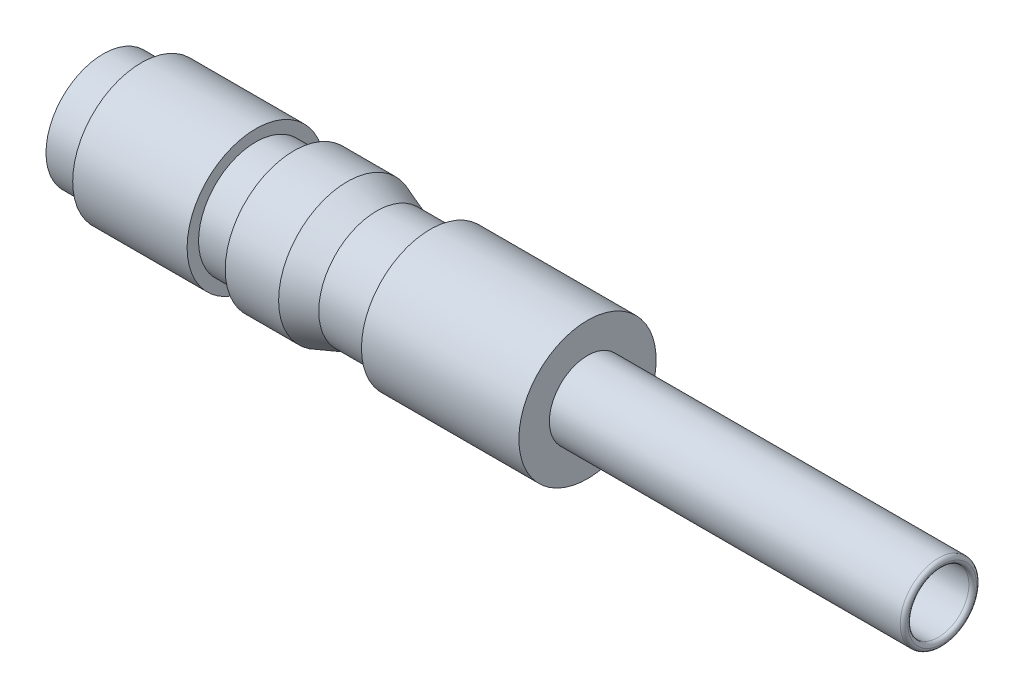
ISO-10303-21;
HEADER;
FILE_DESCRIPTION(('STEP AP214'),'2;1');
FILE_NAME('part.step','',(''),(''),'','','');
FILE_SCHEMA(('AUTOMOTIVE_DESIGN { 1 0 10303 214 1 1 1 1 }'));
ENDSEC;
DATA;
#1=APPLICATION_CONTEXT('core data for automotive mechanical design processes');
#2=APPLICATION_PROTOCOL_DEFINITION('international standard','automotive_design',2000,#1);
#3=PRODUCT_CONTEXT('',#1,'mechanical');
#4=PRODUCT('Part','Part','',(#3));
#5=PRODUCT_RELATED_PRODUCT_CATEGORY('part','',(#4));
#6=PRODUCT_DEFINITION_FORMATION('','',#4);
#7=PRODUCT_DEFINITION_CONTEXT('part definition',#1,'design');
#8=PRODUCT_DEFINITION('design','',#6,#7);
#9=PRODUCT_DEFINITION_SHAPE('','',#8);
#10=(LENGTH_UNIT() NAMED_UNIT(*) SI_UNIT(.MILLI.,.METRE.));
#11=(NAMED_UNIT(*) PLANE_ANGLE_UNIT() SI_UNIT($,.RADIAN.));
#12=(NAMED_UNIT(*) SI_UNIT($,.STERADIAN.) SOLID_ANGLE_UNIT());
#13=UNCERTAINTY_MEASURE_WITH_UNIT(LENGTH_MEASURE(1.E-05),#10,'distance_accuracy_value','');
#14=(GEOMETRIC_REPRESENTATION_CONTEXT(3) GLOBAL_UNCERTAINTY_ASSIGNED_CONTEXT((#13)) GLOBAL_UNIT_ASSIGNED_CONTEXT((#10,
#11,#12)) REPRESENTATION_CONTEXT('',''));
#15=CARTESIAN_POINT('',(0.,0.,0.));
#16=DIRECTION('',(0.,0.,1.));
#17=DIRECTION('',(1.,0.,0.));
#18=AXIS2_PLACEMENT_3D('',#15,#16,#17);
#19=CARTESIAN_POINT('',(5.,0.,0.));
#20=DIRECTION('',(1.,0.,0.));
#21=DIRECTION('',(0.,0.,-1.));
#22=AXIS2_PLACEMENT_3D('',#19,#20,#21);
#23=CYLINDRICAL_SURFACE('',#22,0.4);
#24=CARTESIAN_POINT('',(10.95,0.,0.));
#25=DIRECTION('',(-1.,0.,0.));
#26=DIRECTION('',(0.,0.,1.));
#27=AXIS2_PLACEMENT_3D('',#24,#25,#26);
#28=CIRCLE('',#27,0.4);
#29=CARTESIAN_POINT('',(10.95,0.,0.4));
#30=VERTEX_POINT('',#29);
#31=EDGE_CURVE('E41',#30,#30,#28,.F.);
#32=ORIENTED_EDGE('',*,*,#31,.T.);
#33=EDGE_LOOP('',(#32));
#34=FACE_BOUND('',#33,.T.);
#35=CARTESIAN_POINT('',(6.,0.,0.));
#36=DIRECTION('',(-1.,0.,0.));
#37=DIRECTION('',(0.,0.,1.));
#38=AXIS2_PLACEMENT_3D('',#35,#36,#37);
#39=CIRCLE('',#38,0.4);
#40=CARTESIAN_POINT('',(6.,0.,0.4));
#41=VERTEX_POINT('',#40);
#42=EDGE_CURVE('E48',#41,#41,#39,.F.);
#43=ORIENTED_EDGE('',*,*,#42,.F.);
#44=EDGE_LOOP('',(#43));
#45=FACE_BOUND('',#44,.T.);
#46=ADVANCED_FACE('F33',(#34,#45),#23,.F.);
#47=CARTESIAN_POINT('',(0.,0.,0.));
#48=DIRECTION('',(1.,0.,0.));
#49=DIRECTION('',(0.,0.,-1.));
#50=AXIS2_PLACEMENT_3D('',#47,#48,#49);
#51=PLANE('',#50);
#52=CARTESIAN_POINT('',(0.,0.,0.));
#53=DIRECTION('',(-1.,0.,0.));
#54=DIRECTION('',(0.,0.,1.));
#55=AXIS2_PLACEMENT_3D('',#52,#53,#54);
#56=CIRCLE('',#55,0.6);
#57=CARTESIAN_POINT('',(0.,0.,0.6));
#58=VERTEX_POINT('',#57);
#59=EDGE_CURVE('E90',#58,#58,#56,.T.);
#60=ORIENTED_EDGE('',*,*,#59,.F.);
#61=EDGE_LOOP('',(#60));
#62=FACE_BOUND('',#61,.T.);
#63=CARTESIAN_POINT('',(0.,0.,0.));
#64=DIRECTION('',(-1.,0.,0.));
#65=DIRECTION('',(0.,0.,1.));
#66=AXIS2_PLACEMENT_3D('',#63,#64,#65);
#67=CIRCLE('',#66,0.75);
#68=CARTESIAN_POINT('',(0.,0.,0.75));
#69=VERTEX_POINT('',#68);
#70=EDGE_CURVE('E45',#69,#69,#67,.T.);
#71=ORIENTED_EDGE('',*,*,#70,.T.);
#72=EDGE_LOOP('',(#71));
#73=FACE_BOUND('',#72,.T.);
#74=ADVANCED_FACE('F105',(#62,#73),#51,.F.);
#75=CARTESIAN_POINT('',(-4.99745454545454,0.,0.));
#76=DIRECTION('',(-1.,0.,0.));
#77=DIRECTION('',(0.,0.,1.));
#78=AXIS2_PLACEMENT_3D('',#75,#76,#77);
#79=CYLINDRICAL_SURFACE('',#78,0.749999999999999);
#80=ORIENTED_EDGE('',*,*,#70,.F.);
#81=EDGE_LOOP('',(#80));
#82=FACE_BOUND('',#81,.T.);
#83=CARTESIAN_POINT('',(0.5,0.,0.));
#84=DIRECTION('',(-1.,0.,0.));
#85=DIRECTION('',(0.,0.,1.));
#86=AXIS2_PLACEMENT_3D('',#83,#84,#85);
#87=CIRCLE('',#86,0.749999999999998);
#88=CARTESIAN_POINT('',(0.5,0.,0.749999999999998));
#89=VERTEX_POINT('',#88);
#90=EDGE_CURVE('E55',#89,#89,#87,.T.);
#91=ORIENTED_EDGE('',*,*,#90,.T.);
#92=EDGE_LOOP('',(#91));
#93=FACE_BOUND('',#92,.T.);
#94=ADVANCED_FACE('F108',(#82,#93),#79,.T.);
#95=CARTESIAN_POINT('',(0.5,0.749999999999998,0.));
#96=DIRECTION('',(1.,0.,0.));
#97=DIRECTION('',(0.,0.,-1.));
#98=AXIS2_PLACEMENT_3D('',#95,#96,#97);
#99=PLANE('',#98);
#100=ORIENTED_EDGE('',*,*,#90,.F.);
#101=EDGE_LOOP('',(#100));
#102=FACE_BOUND('',#101,.T.);
#103=CARTESIAN_POINT('',(0.5,0.,0.));
#104=DIRECTION('',(-1.,0.,0.));
#105=DIRECTION('',(0.,0.,1.));
#106=AXIS2_PLACEMENT_3D('',#103,#104,#105);
#107=CIRCLE('',#106,0.899999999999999);
#108=CARTESIAN_POINT('',(0.5,0.,0.899999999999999));
#109=VERTEX_POINT('',#108);
#110=EDGE_CURVE('E58',#109,#109,#107,.T.);
#111=ORIENTED_EDGE('',*,*,#110,.T.);
#112=EDGE_LOOP('',(#111));
#113=FACE_BOUND('',#112,.T.);
#114=ADVANCED_FACE('F114',(#102,#113),#99,.F.);
#115=CARTESIAN_POINT('',(-4.99745454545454,0.,0.));
#116=DIRECTION('',(-1.,0.,0.));
#117=DIRECTION('',(0.,0.,1.));
#118=AXIS2_PLACEMENT_3D('',#115,#116,#117);
#119=CYLINDRICAL_SURFACE('',#118,0.899999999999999);
#120=ORIENTED_EDGE('',*,*,#110,.F.);
#121=EDGE_LOOP('',(#120));
#122=FACE_BOUND('',#121,.T.);
#123=CARTESIAN_POINT('',(2.,0.,0.));
#124=DIRECTION('',(-1.,0.,0.));
#125=DIRECTION('',(0.,0.,1.));
#126=AXIS2_PLACEMENT_3D('',#123,#124,#125);
#127=CIRCLE('',#126,0.899999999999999);
#128=CARTESIAN_POINT('',(2.,0.,0.899999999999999));
#129=VERTEX_POINT('',#128);
#130=EDGE_CURVE('E61',#129,#129,#127,.T.);
#131=ORIENTED_EDGE('',*,*,#130,.T.);
#132=EDGE_LOOP('',(#131));
#133=FACE_BOUND('',#132,.T.);
#134=ADVANCED_FACE('F120',(#122,#133),#119,.T.);
#135=CARTESIAN_POINT('',(2.,0.899999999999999,0.));
#136=DIRECTION('',(-1.,0.,0.));
#137=DIRECTION('',(0.,0.,1.));
#138=AXIS2_PLACEMENT_3D('',#135,#136,#137);
#139=PLANE('',#138);
#140=ORIENTED_EDGE('',*,*,#130,.F.);
#141=EDGE_LOOP('',(#140));
#142=FACE_BOUND('',#141,.T.);
#143=CARTESIAN_POINT('',(2.,0.,0.));
#144=DIRECTION('',(-1.,0.,0.));
#145=DIRECTION('',(0.,0.,1.));
#146=AXIS2_PLACEMENT_3D('',#143,#144,#145);
#147=CIRCLE('',#146,0.749999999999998);
#148=CARTESIAN_POINT('',(2.,0.,0.749999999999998));
#149=VERTEX_POINT('',#148);
#150=EDGE_CURVE('E64',#149,#149,#147,.T.);
#151=ORIENTED_EDGE('',*,*,#150,.T.);
#152=EDGE_LOOP('',(#151));
#153=FACE_BOUND('',#152,.T.);
#154=ADVANCED_FACE('F126',(#142,#153),#139,.F.);
#155=CARTESIAN_POINT('',(-4.99745454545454,0.,0.));
#156=DIRECTION('',(-1.,0.,0.));
#157=DIRECTION('',(0.,0.,1.));
#158=AXIS2_PLACEMENT_3D('',#155,#156,#157);
#159=CYLINDRICAL_SURFACE('',#158,0.749999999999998);
#160=ORIENTED_EDGE('',*,*,#150,.F.);
#161=EDGE_LOOP('',(#160));
#162=FACE_BOUND('',#161,.T.);
#163=CARTESIAN_POINT('',(2.5,0.,0.));
#164=DIRECTION('',(-1.,0.,0.));
#165=DIRECTION('',(0.,0.,1.));
#166=AXIS2_PLACEMENT_3D('',#163,#164,#165);
#167=CIRCLE('',#166,0.749999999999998);
#168=CARTESIAN_POINT('',(2.5,0.,0.749999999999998));
#169=VERTEX_POINT('',#168);
#170=EDGE_CURVE('E67',#169,#169,#167,.T.);
#171=ORIENTED_EDGE('',*,*,#170,.T.);
#172=EDGE_LOOP('',(#171));
#173=FACE_BOUND('',#172,.T.);
#174=ADVANCED_FACE('F132',(#162,#173),#159,.T.);
#175=CARTESIAN_POINT('',(2.5,0.749999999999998,0.));
#176=DIRECTION('',(1.,0.,0.));
#177=DIRECTION('',(0.,0.,-1.));
#178=AXIS2_PLACEMENT_3D('',#175,#176,#177);
#179=PLANE('',#178);
#180=ORIENTED_EDGE('',*,*,#170,.F.);
#181=EDGE_LOOP('',(#180));
#182=FACE_BOUND('',#181,.T.);
#183=CARTESIAN_POINT('',(2.5,0.,0.));
#184=DIRECTION('',(-1.,0.,0.));
#185=DIRECTION('',(0.,0.,1.));
#186=AXIS2_PLACEMENT_3D('',#183,#184,#185);
#187=CIRCLE('',#186,0.899999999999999);
#188=CARTESIAN_POINT('',(2.5,0.,0.899999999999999));
#189=VERTEX_POINT('',#188);
#190=EDGE_CURVE('E70',#189,#189,#187,.T.);
#191=ORIENTED_EDGE('',*,*,#190,.T.);
#192=EDGE_LOOP('',(#191));
#193=FACE_BOUND('',#192,.T.);
#194=ADVANCED_FACE('F138',(#182,#193),#179,.F.);
#195=CARTESIAN_POINT('',(-4.99745454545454,0.,0.));
#196=DIRECTION('',(-1.,0.,0.));
#197=DIRECTION('',(0.,0.,1.));
#198=AXIS2_PLACEMENT_3D('',#195,#196,#197);
#199=CYLINDRICAL_SURFACE('',#198,0.899999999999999);
#200=ORIENTED_EDGE('',*,*,#190,.F.);
#201=EDGE_LOOP('',(#200));
#202=FACE_BOUND('',#201,.T.);
#203=CARTESIAN_POINT('',(3.2,0.,0.));
#204=DIRECTION('',(-1.,0.,0.));
#205=DIRECTION('',(0.,0.,1.));
#206=AXIS2_PLACEMENT_3D('',#203,#204,#205);
#207=CIRCLE('',#206,0.899999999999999);
#208=CARTESIAN_POINT('',(3.2,0.,0.899999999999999));
#209=VERTEX_POINT('',#208);
#210=EDGE_CURVE('E73',#209,#209,#207,.T.);
#211=ORIENTED_EDGE('',*,*,#210,.T.);
#212=EDGE_LOOP('',(#211));
#213=FACE_BOUND('',#212,.T.);
#214=ADVANCED_FACE('F144',(#202,#213),#199,.T.);
#215=CARTESIAN_POINT('',(3.58601099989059,0.,0.));
#216=DIRECTION('',(-1.,0.,0.));
#217=DIRECTION('',(0.,0.,1.));
#218=AXIS2_PLACEMENT_3D('',#215,#216,#217);
#219=CONICAL_SURFACE('',#218,0.75950348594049,0.349065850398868);
#220=ORIENTED_EDGE('',*,*,#210,.F.);
#221=EDGE_LOOP('',(#220));
#222=FACE_BOUND('',#221,.T.);
#223=CARTESIAN_POINT('',(3.58601099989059,0.,0.));
#224=DIRECTION('',(-1.,0.,0.));
#225=DIRECTION('',(0.,0.,1.));
#226=AXIS2_PLACEMENT_3D('',#223,#224,#225);
#227=CIRCLE('',#226,0.75950348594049);
#228=CARTESIAN_POINT('',(3.58601099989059,0.,0.75950348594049));
#229=VERTEX_POINT('',#228);
#230=EDGE_CURVE('E76',#229,#229,#227,.T.);
#231=ORIENTED_EDGE('',*,*,#230,.T.);
#232=EDGE_LOOP('',(#231));
#233=FACE_BOUND('',#232,.T.);
#234=ADVANCED_FACE('F150',(#222,#233),#219,.T.);
#235=CARTESIAN_POINT('',(-4.99745454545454,0.,0.));
#236=DIRECTION('',(-1.,0.,0.));
#237=DIRECTION('',(0.,0.,1.));
#238=AXIS2_PLACEMENT_3D('',#235,#236,#237);
#239=CYLINDRICAL_SURFACE('',#238,0.75950348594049);
#240=ORIENTED_EDGE('',*,*,#230,.F.);
#241=EDGE_LOOP('',(#240));
#242=FACE_BOUND('',#241,.T.);
#243=CARTESIAN_POINT('',(4.28601099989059,0.,0.));
#244=DIRECTION('',(-1.,0.,0.));
#245=DIRECTION('',(0.,0.,1.));
#246=AXIS2_PLACEMENT_3D('',#243,#244,#245);
#247=CIRCLE('',#246,0.75950348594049);
#248=CARTESIAN_POINT('',(4.28601099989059,0.,0.75950348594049));
#249=VERTEX_POINT('',#248);
#250=EDGE_CURVE('E79',#249,#249,#247,.T.);
#251=ORIENTED_EDGE('',*,*,#250,.T.);
#252=EDGE_LOOP('',(#251));
#253=FACE_BOUND('',#252,.T.);
#254=ADVANCED_FACE('F156',(#242,#253),#239,.T.);
#255=CARTESIAN_POINT('',(4.28601099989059,0.75950348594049,0.));
#256=DIRECTION('',(1.,0.,0.));
#257=DIRECTION('',(0.,0.,-1.));
#258=AXIS2_PLACEMENT_3D('',#255,#256,#257);
#259=PLANE('',#258);
#260=ORIENTED_EDGE('',*,*,#250,.F.);
#261=EDGE_LOOP('',(#260));
#262=FACE_BOUND('',#261,.T.);
#263=CARTESIAN_POINT('',(4.28601099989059,0.,0.));
#264=DIRECTION('',(-1.,0.,0.));
#265=DIRECTION('',(0.,0.,1.));
#266=AXIS2_PLACEMENT_3D('',#263,#264,#265);
#267=CIRCLE('',#266,0.899999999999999);
#268=CARTESIAN_POINT('',(4.28601099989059,0.,0.899999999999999));
#269=VERTEX_POINT('',#268);
#270=EDGE_CURVE('E82',#269,#269,#267,.T.);
#271=ORIENTED_EDGE('',*,*,#270,.T.);
#272=EDGE_LOOP('',(#271));
#273=FACE_BOUND('',#272,.T.);
#274=ADVANCED_FACE('F162',(#262,#273),#259,.F.);
#275=CARTESIAN_POINT('',(-4.99745454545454,0.,0.));
#276=DIRECTION('',(-1.,0.,0.));
#277=DIRECTION('',(0.,0.,1.));
#278=AXIS2_PLACEMENT_3D('',#275,#276,#277);
#279=CYLINDRICAL_SURFACE('',#278,0.899999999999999);
#280=ORIENTED_EDGE('',*,*,#270,.F.);
#281=EDGE_LOOP('',(#280));
#282=FACE_BOUND('',#281,.T.);
#283=CARTESIAN_POINT('',(6.35,0.,0.));
#284=DIRECTION('',(-1.,0.,0.));
#285=DIRECTION('',(0.,0.,1.));
#286=AXIS2_PLACEMENT_3D('',#283,#284,#285);
#287=CIRCLE('',#286,0.899999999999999);
#288=CARTESIAN_POINT('',(6.35,0.,0.899999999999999));
#289=VERTEX_POINT('',#288);
#290=EDGE_CURVE('E85',#289,#289,#287,.T.);
#291=ORIENTED_EDGE('',*,*,#290,.T.);
#292=EDGE_LOOP('',(#291));
#293=FACE_BOUND('',#292,.T.);
#294=ADVANCED_FACE('F168',(#282,#293),#279,.T.);
#295=CARTESIAN_POINT('',(6.35,0.899999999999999,0.));
#296=DIRECTION('',(-1.,0.,0.));
#297=DIRECTION('',(0.,0.,1.));
#298=AXIS2_PLACEMENT_3D('',#295,#296,#297);
#299=PLANE('',#298);
#300=ORIENTED_EDGE('',*,*,#290,.F.);
#301=EDGE_LOOP('',(#300));
#302=FACE_BOUND('',#301,.T.);
#303=CARTESIAN_POINT('',(6.35,0.,0.));
#304=DIRECTION('',(-1.,0.,0.));
#305=DIRECTION('',(0.,0.,1.));
#306=AXIS2_PLACEMENT_3D('',#303,#304,#305);
#307=CIRCLE('',#306,0.499999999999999);
#308=CARTESIAN_POINT('',(6.35,0.,0.499999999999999));
#309=VERTEX_POINT('',#308);
#310=EDGE_CURVE('E51',#309,#309,#307,.T.);
#311=ORIENTED_EDGE('',*,*,#310,.T.);
#312=EDGE_LOOP('',(#311));
#313=FACE_BOUND('',#312,.T.);
#314=ADVANCED_FACE('F174',(#302,#313),#299,.F.);
#315=CARTESIAN_POINT('',(-4.99745454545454,0.,0.));
#316=DIRECTION('',(-1.,0.,0.));
#317=DIRECTION('',(0.,0.,1.));
#318=AXIS2_PLACEMENT_3D('',#315,#316,#317);
#319=CYLINDRICAL_SURFACE('',#318,0.499999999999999);
#320=CARTESIAN_POINT('',(10.95,0.,0.));
#321=DIRECTION('',(-1.,0.,0.));
#322=DIRECTION('',(0.,0.,1.));
#323=AXIS2_PLACEMENT_3D('',#320,#321,#322);
#324=CIRCLE('',#323,0.499999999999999);
#325=CARTESIAN_POINT('',(10.95,0.,0.499999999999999));
#326=VERTEX_POINT('',#325);
#327=EDGE_CURVE('E10',#326,#326,#324,.T.);
#328=ORIENTED_EDGE('',*,*,#327,.T.);
#329=EDGE_LOOP('',(#328));
#330=FACE_BOUND('',#329,.T.);
#331=ORIENTED_EDGE('',*,*,#310,.F.);
#332=EDGE_LOOP('',(#331));
#333=FACE_BOUND('',#332,.T.);
#334=ADVANCED_FACE('F180',(#330,#333),#319,.T.);
#335=CARTESIAN_POINT('',(6.,0.,0.));
#336=DIRECTION('',(-1.,0.,0.));
#337=DIRECTION('',(0.,0.,1.));
#338=AXIS2_PLACEMENT_3D('',#335,#336,#337);
#339=PLANE('',#338);
#340=CARTESIAN_POINT('',(6.,0.,0.));
#341=DIRECTION('',(-1.,0.,0.));
#342=DIRECTION('',(0.,0.,1.));
#343=AXIS2_PLACEMENT_3D('',#340,#341,#342);
#344=CIRCLE('',#343,0.6);
#345=CARTESIAN_POINT('',(6.,0.,0.6));
#346=VERTEX_POINT('',#345);
#347=EDGE_CURVE('E52',#346,#346,#344,.T.);
#348=ORIENTED_EDGE('',*,*,#347,.T.);
#349=EDGE_LOOP('',(#348));
#350=FACE_BOUND('',#349,.T.);
#351=ORIENTED_EDGE('',*,*,#42,.T.);
#352=EDGE_LOOP('',(#351));
#353=FACE_BOUND('',#352,.T.);
#354=ADVANCED_FACE('F96',(#350,#353),#339,.T.);
#355=CARTESIAN_POINT('',(6.,0.,0.));
#356=DIRECTION('',(-1.,0.,0.));
#357=DIRECTION('',(0.,0.,1.));
#358=AXIS2_PLACEMENT_3D('',#355,#356,#357);
#359=CYLINDRICAL_SURFACE('',#358,0.6);
#360=ORIENTED_EDGE('',*,*,#347,.F.);
#361=EDGE_LOOP('',(#360));
#362=FACE_BOUND('',#361,.T.);
#363=ORIENTED_EDGE('',*,*,#59,.T.);
#364=EDGE_LOOP('',(#363));
#365=FACE_BOUND('',#364,.T.);
#366=ADVANCED_FACE('F99',(#362,#365),#359,.F.);
#367=CARTESIAN_POINT('',(10.95,0.,0.));
#368=DIRECTION('',(-1.,0.,0.));
#369=DIRECTION('',(0.,0.,1.));
#370=AXIS2_PLACEMENT_3D('',#367,#368,#369);
#371=TOROIDAL_SURFACE('',#370,0.449999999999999,0.05);
#372=ORIENTED_EDGE('',*,*,#327,.F.);
#373=EDGE_LOOP('',(#372));
#374=FACE_BOUND('',#373,.T.);
#375=CARTESIAN_POINT('',(11.,0.,0.));
#376=DIRECTION('',(-1.,0.,0.));
#377=DIRECTION('',(0.,0.,1.));
#378=AXIS2_PLACEMENT_3D('',#375,#376,#377);
#379=CIRCLE('',#378,0.449999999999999);
#380=CARTESIAN_POINT('',(11.,0.,0.449999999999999));
#381=VERTEX_POINT('',#380);
#382=EDGE_CURVE('E37',#381,#381,#379,.F.);
#383=ORIENTED_EDGE('',*,*,#382,.F.);
#384=EDGE_LOOP('',(#383));
#385=FACE_BOUND('',#384,.T.);
#386=ADVANCED_FACE('F35',(#374,#385),#371,.T.);
#387=CARTESIAN_POINT('',(10.95,0.,0.));
#388=DIRECTION('',(-1.,0.,0.));
#389=DIRECTION('',(0.,0.,1.));
#390=AXIS2_PLACEMENT_3D('',#387,#388,#389);
#391=TOROIDAL_SURFACE('',#390,0.45,0.05);
#392=ORIENTED_EDGE('',*,*,#382,.T.);
#393=EDGE_LOOP('',(#392));
#394=FACE_BOUND('',#393,.T.);
#395=ORIENTED_EDGE('',*,*,#31,.F.);
#396=EDGE_LOOP('',(#395));
#397=FACE_BOUND('',#396,.T.);
#398=ADVANCED_FACE('F199',(#394,#397),#391,.T.);
#399=CLOSED_SHELL('',(#46,#74,#94,#114,#134,#154,#174,#194,#214,#234,#254,#274,#294,#314,#334,
#354,#366,#386,#398));
#400=MANIFOLD_SOLID_BREP('B2',#399);
#401=ADVANCED_BREP_SHAPE_REPRESENTATION('',(#18,#400),#14);
#402=SHAPE_DEFINITION_REPRESENTATION(#9,#401);
ENDSEC;
END-ISO-10303-21;
